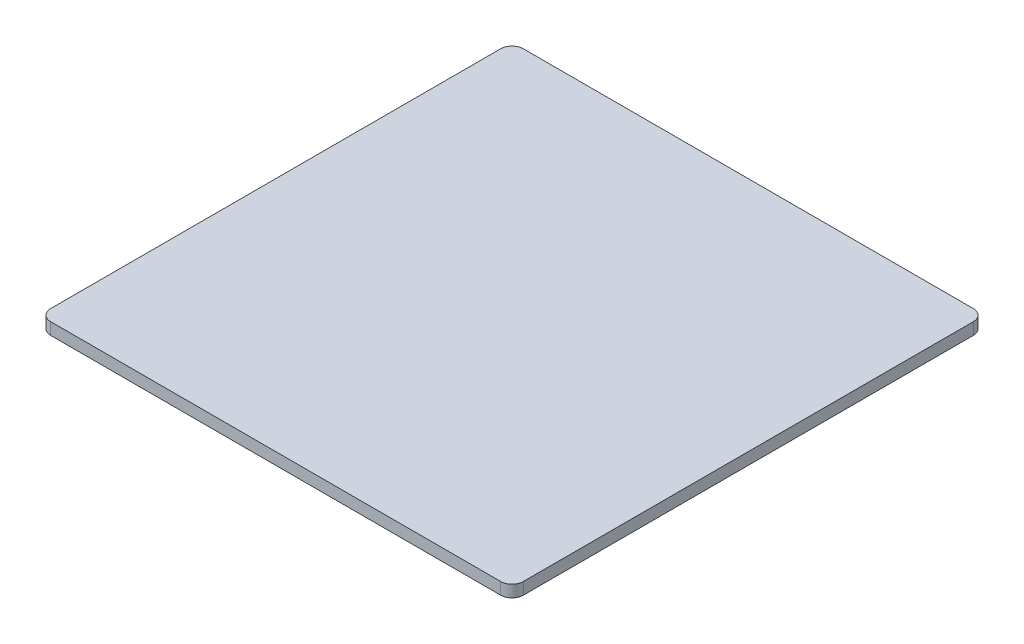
from build123d import *

# Parameters (mm, degrees)
SKETCH1_W           = 31.75
SKETCH1_H           = 31.75
BOSS_EXTRUDE1_DEPTH = 0.4
FILLET1_R           = 0.762


with BuildPart() as part:
    # Sketch1 → Boss-Extrude1 (new, symmetric)
    with BuildSketch(Plane(origin=(0, 0, 0), x_dir=(1, 0, 0), z_dir=(0, 1, 0))):
        Rectangle(SKETCH1_W, SKETCH1_H)
    extrude(amount=BOSS_EXTRUDE1_DEPTH, both=True)

    # Fillet1
    fillet1_edges = [part.edges().sort_by_distance(p)[0] for p in [
        (15.875, 0, 15.875),
        (-15.875, 0, 15.875),
        (-15.875, 0, -15.875),
        (15.875, 0, -15.875),
    ]]
    fillet(fillet1_edges, radius=FILLET1_R)


solid = part.part
